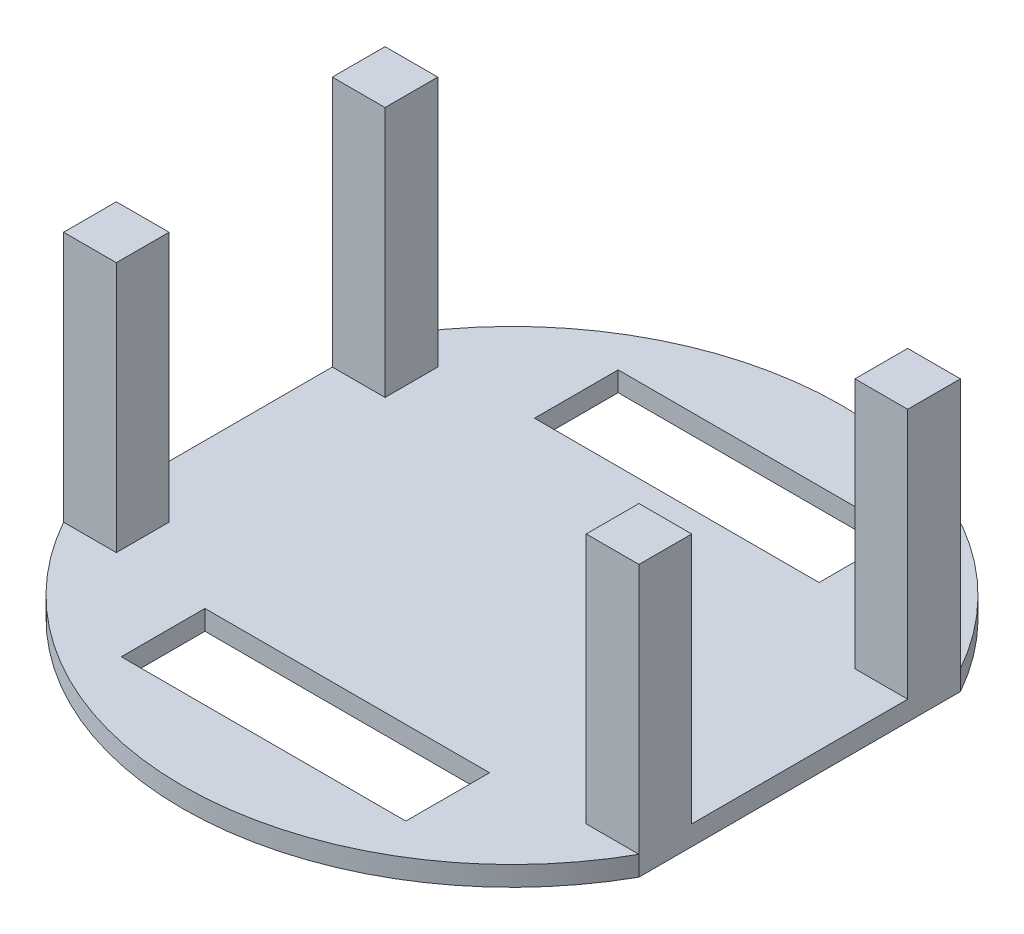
from build123d import *

# Parameters (mm, degrees)
SKETCH1_R           = 50
BOSS_EXTRUDE1_DEPTH = 3
CUT_EXTRUDE1_DEPTH  = 3
SKETCH3_W           = 8
SKETCH3_H           = 8
BOSS_EXTRUDE2_DEPTH = 38.1
CUT_EXTRUDE2_DEPTH  = 3


with BuildPart() as part:
    # Sketch1 → Boss-Extrude1 (new body)
    with BuildSketch(Plane(origin=(0, 0, 0), x_dir=(1, 0, 0), z_dir=(0, 1, 0))):
        with Locations(Location((0, 0, 0), (0, 0, 270))):
            Circle(SKETCH1_R)
    extrude(amount=BOSS_EXTRUDE1_DEPTH)

    # Sketch2 → Cut-Extrude1 (cut)
    with BuildSketch(Plane(origin=(0, 3, 0), x_dir=(1, 0, 0), z_dir=(0, 1, 0))):
        Polygon((43.65, 0), (43.65, 57.987512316), (61.272586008, 57.987512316), (61.272586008, -41.685273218), (43.65, -41.685273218), align=None)
        Polygon((-43.65, 0), (-43.65, 57.987512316), (-62.172307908, 57.987512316), (-61.151085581, -41.685273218), (-43.65, -41.685273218), align=None)
    extrude(amount=-CUT_EXTRUDE1_DEPTH, mode=Mode.SUBTRACT)

    # Sketch3 → Boss-Extrude2 (add)
    with BuildSketch(Plane(origin=(0, 3, 0), x_dir=(1, 0, 0), z_dir=(0, 1, 0))):
        with Locations((-39.65, 20.386010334)):
            Rectangle(SKETCH3_W, SKETCH3_H)
        with Locations((39.65, 20.386010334)):
            Rectangle(SKETCH3_W, SKETCH3_H)
        with Locations((39.65, -20.386010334)):
            Rectangle(SKETCH3_W, SKETCH3_H)
        with Locations((-39.65, -20.386010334)):
            Rectangle(SKETCH3_W, SKETCH3_H)
    extrude(amount=BOSS_EXTRUDE2_DEPTH)

    # Sketch4 → Cut-Extrude2 (cut)
    with BuildSketch(Plane.XZ):
        Polygon((0, 25), (21.59, 25), (21.59, 37.7), (-21.59, 37.7), (-21.59, 25), align=None)
        Polygon((0, -25), (21.59, -25), (21.59, -37.7), (-21.59, -37.7), (-21.59, -25), align=None)
    extrude(amount=-CUT_EXTRUDE2_DEPTH, mode=Mode.SUBTRACT)


solid = part.part
